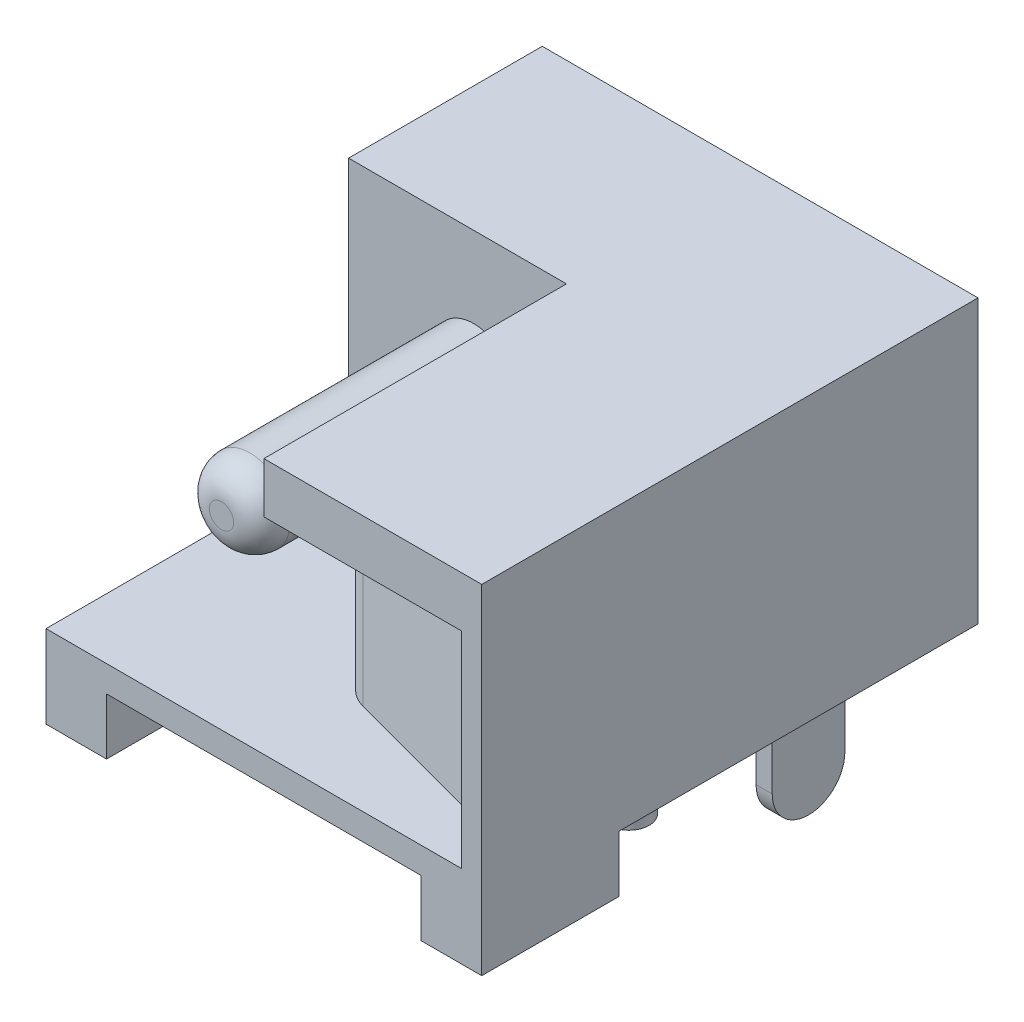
ISO-10303-21;
HEADER;
FILE_DESCRIPTION(('STEP AP214'),'2;1');
FILE_NAME('part.step','',(''),(''),'','','');
FILE_SCHEMA(('AUTOMOTIVE_DESIGN { 1 0 10303 214 1 1 1 1 }'));
ENDSEC;
DATA;
#1=APPLICATION_CONTEXT('core data for automotive mechanical design processes');
#2=APPLICATION_PROTOCOL_DEFINITION('international standard','automotive_design',2000,#1);
#3=PRODUCT_CONTEXT('',#1,'mechanical');
#4=PRODUCT('Part','Part','',(#3));
#5=PRODUCT_RELATED_PRODUCT_CATEGORY('part','',(#4));
#6=PRODUCT_DEFINITION_FORMATION('','',#4);
#7=PRODUCT_DEFINITION_CONTEXT('part definition',#1,'design');
#8=PRODUCT_DEFINITION('design','',#6,#7);
#9=PRODUCT_DEFINITION_SHAPE('','',#8);
#10=(LENGTH_UNIT() NAMED_UNIT(*) SI_UNIT(.MILLI.,.METRE.));
#11=(NAMED_UNIT(*) PLANE_ANGLE_UNIT() SI_UNIT($,.RADIAN.));
#12=(NAMED_UNIT(*) SI_UNIT($,.STERADIAN.) SOLID_ANGLE_UNIT());
#13=UNCERTAINTY_MEASURE_WITH_UNIT(LENGTH_MEASURE(1.E-05),#10,'distance_accuracy_value','');
#14=(GEOMETRIC_REPRESENTATION_CONTEXT(3) GLOBAL_UNCERTAINTY_ASSIGNED_CONTEXT((#13)) GLOBAL_UNIT_ASSIGNED_CONTEXT((#10,
#11,#12)) REPRESENTATION_CONTEXT('',''));
#15=CARTESIAN_POINT('',(0.,0.,0.));
#16=DIRECTION('',(0.,0.,1.));
#17=DIRECTION('',(1.,0.,0.));
#18=AXIS2_PLACEMENT_3D('',#15,#16,#17);
#19=CARTESIAN_POINT('',(-2.3,4.8,-1.25));
#20=DIRECTION('',(0.,0.,1.));
#21=DIRECTION('',(1.,0.,0.));
#22=AXIS2_PLACEMENT_3D('',#19,#20,#21);
#23=PLANE('',#22);
#24=CARTESIAN_POINT('',(-2.3,4.8,-1.25));
#25=DIRECTION('',(0.,0.,-1.));
#26=DIRECTION('',(-1.,0.,0.));
#27=AXIS2_PLACEMENT_3D('',#24,#25,#26);
#28=CIRCLE('',#27,0.300000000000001);
#29=CARTESIAN_POINT('',(-2.6,4.8,-1.25));
#30=VERTEX_POINT('',#29);
#31=CARTESIAN_POINT('',(-2.,4.8,-1.25));
#32=VERTEX_POINT('',#31);
#33=EDGE_CURVE('E365',#30,#32,#28,.T.);
#34=ORIENTED_EDGE('',*,*,#33,.F.);
#35=CARTESIAN_POINT('',(-2.3,4.8,-1.25));
#36=DIRECTION('',(0.,0.,-1.));
#37=DIRECTION('',(1.,0.,0.));
#38=AXIS2_PLACEMENT_3D('',#35,#36,#37);
#39=CIRCLE('',#38,0.3);
#40=EDGE_CURVE('E366',#32,#30,#39,.T.);
#41=ORIENTED_EDGE('',*,*,#40,.F.);
#42=EDGE_LOOP('',(#34,#41));
#43=FACE_BOUND('',#42,.T.);
#44=ADVANCED_FACE('F15',(#43),#23,.T.);
#45=CARTESIAN_POINT('',(0.46155033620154,1.45,-3.22455518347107));
#46=DIRECTION('',(0.,1.,0.));
#47=DIRECTION('',(0.,0.,-1.));
#48=AXIS2_PLACEMENT_3D('',#45,#46,#47);
#49=CYLINDRICAL_SURFACE('',#48,1.);
#50=CARTESIAN_POINT('',(0.46155033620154,6.55,-3.22455518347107));
#51=DIRECTION('',(0.,1.,0.));
#52=DIRECTION('',(0.,0.,-1.));
#53=AXIS2_PLACEMENT_3D('',#50,#51,#52);
#54=CIRCLE('',#53,1.);
#55=CARTESIAN_POINT('',(-0.523257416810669,6.55,-3.398203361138));
#56=VERTEX_POINT('',#55);
#57=CARTESIAN_POINT('',(0.,6.55,-2.33744116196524));
#58=VERTEX_POINT('',#57);
#59=EDGE_CURVE('E169',#56,#58,#54,.T.);
#60=ORIENTED_EDGE('',*,*,#59,.F.);
#61=DIRECTION('',(0.,1.,0.));
#62=VECTOR('',#61,1.);
#63=CARTESIAN_POINT('',(-0.523257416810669,1.45,-3.398203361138));
#64=LINE('',#63,#62);
#65=CARTESIAN_POINT('',(-0.523257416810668,1.45,-3.398203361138));
#66=VERTEX_POINT('',#65);
#67=EDGE_CURVE('E159',#66,#56,#64,.T.);
#68=ORIENTED_EDGE('',*,*,#67,.F.);
#69=CARTESIAN_POINT('',(0.46155033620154,1.45,-3.22455518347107));
#70=DIRECTION('',(0.,1.,0.));
#71=DIRECTION('',(0.,0.,-1.));
#72=AXIS2_PLACEMENT_3D('',#69,#70,#71);
#73=CIRCLE('',#72,1.);
#74=CARTESIAN_POINT('',(0.202731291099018,1.45,-2.258629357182));
#75=VERTEX_POINT('',#74);
#76=EDGE_CURVE('E150',#66,#75,#73,.T.);
#77=ORIENTED_EDGE('',*,*,#76,.T.);
#78=DIRECTION('',(0.,1.,0.));
#79=VECTOR('',#78,1.);
#80=CARTESIAN_POINT('',(0.20273129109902,6.55,-2.258629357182));
#81=LINE('',#80,#79);
#82=CARTESIAN_POINT('',(0.202731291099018,6.55,-2.258629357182));
#83=VERTEX_POINT('',#82);
#84=EDGE_CURVE('E156',#83,#75,#81,.F.);
#85=ORIENTED_EDGE('',*,*,#84,.F.);
#86=CARTESIAN_POINT('',(0.46155033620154,6.55,-3.22455518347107));
#87=DIRECTION('',(0.,1.,0.));
#88=DIRECTION('',(0.,0.,-1.));
#89=AXIS2_PLACEMENT_3D('',#86,#87,#88);
#90=CIRCLE('',#89,1.);
#91=EDGE_CURVE('E161',#83,#58,#90,.F.);
#92=ORIENTED_EDGE('',*,*,#91,.T.);
#93=EDGE_LOOP('',(#60,#68,#77,#85,#92));
#94=FACE_BOUND('',#93,.T.);
#95=ADVANCED_FACE('F155',(#94),#49,.T.);
#96=CARTESIAN_POINT('',(-2.,4.8,-1.95));
#97=DIRECTION('',(0.,1.,0.));
#98=DIRECTION('',(1.,0.,0.));
#99=AXIS2_PLACEMENT_3D('',#96,#97,#98);
#100=CIRCLE('',#99,0.7);
#101=TRIMMED_CURVE('',#100,(PARAMETER_VALUE(-2.01370737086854)),
(PARAMETER_VALUE(2.01370737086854)),.T.,.PARAMETER.);
#102=CARTESIAN_POINT('',(-2.3,4.8,-1.95));
#103=DIRECTION('',(0.,0.,1.));
#104=AXIS1_PLACEMENT('',#102,#103);
#105=SURFACE_OF_REVOLUTION('',#101,#104);
#106=ORIENTED_EDGE('',*,*,#40,.T.);
#107=ORIENTED_EDGE('',*,*,#33,.T.);
#108=EDGE_LOOP('',(#106,#107));
#109=FACE_BOUND('',#108,.T.);
#110=CARTESIAN_POINT('',(-2.3,4.8,-1.95));
#111=DIRECTION('',(0.,0.,-1.));
#112=DIRECTION('',(-1.,0.,0.));
#113=AXIS2_PLACEMENT_3D('',#110,#111,#112);
#114=CIRCLE('',#113,1.);
#115=CARTESIAN_POINT('',(-3.3,4.8,-1.95));
#116=VERTEX_POINT('',#115);
#117=EDGE_CURVE('E265',#116,#116,#114,.T.);
#118=ORIENTED_EDGE('',*,*,#117,.F.);
#119=EDGE_LOOP('',(#118));
#120=FACE_BOUND('',#119,.T.);
#121=ADVANCED_FACE('F298',(#109,#120),#105,.F.);
#122=CARTESIAN_POINT('',(0.2,6.55,-7.5));
#123=DIRECTION('',(0.,1.,0.));
#124=DIRECTION('',(0.,0.,-1.));
#125=AXIS2_PLACEMENT_3D('',#122,#123,#124);
#126=PLANE('',#125);
#127=ORIENTED_EDGE('',*,*,#59,.T.);
#128=DIRECTION('',(0.,0.,1.));
#129=VECTOR('',#128,1.);
#130=CARTESIAN_POINT('',(0.,6.55,-7.5));
#131=LINE('',#130,#129);
#132=CARTESIAN_POINT('',(0.,6.55,-6.36574363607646));
#133=VERTEX_POINT('',#132);
#134=EDGE_CURVE('E261',#58,#133,#131,.F.);
#135=ORIENTED_EDGE('',*,*,#134,.T.);
#136=DIRECTION('',(-0.173648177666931,0.,0.984807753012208));
#137=VECTOR('',#136,1.);
#138=CARTESIAN_POINT('',(0.2,6.55,-7.5));
#139=LINE('',#138,#137);
#140=EDGE_CURVE('E235',#56,#133,#139,.F.);
#141=ORIENTED_EDGE('',*,*,#140,.F.);
#142=EDGE_LOOP('',(#127,#135,#141));
#143=FACE_BOUND('',#142,.T.);
#144=ADVANCED_FACE('F302',(#143),#126,.T.);
#145=CARTESIAN_POINT('',(4.9,6.55,-1.));
#146=DIRECTION('',(-0.258819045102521,0.,0.965925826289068));
#147=DIRECTION('',(0.965925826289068,0.,0.258819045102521));
#148=AXIS2_PLACEMENT_3D('',#145,#146,#147);
#149=PLANE('',#148);
#150=DIRECTION('',(0.965925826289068,0.,0.258819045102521));
#151=VECTOR('',#150,1.);
#152=CARTESIAN_POINT('',(0.202731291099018,1.45,-2.258629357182));
#153=LINE('',#152,#151);
#154=CARTESIAN_POINT('',(4.9,1.45,-1.));
#155=VERTEX_POINT('',#154);
#156=EDGE_CURVE('E166',#75,#155,#153,.T.);
#157=ORIENTED_EDGE('',*,*,#156,.T.);
#158=DIRECTION('',(0.,1.,0.));
#159=VECTOR('',#158,1.);
#160=CARTESIAN_POINT('',(4.9,6.55,-1.));
#161=LINE('',#160,#159);
#162=CARTESIAN_POINT('',(4.9,6.55,-1.));
#163=VERTEX_POINT('',#162);
#164=EDGE_CURVE('E180',#155,#163,#161,.T.);
#165=ORIENTED_EDGE('',*,*,#164,.T.);
#166=DIRECTION('',(-0.965925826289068,0.,-0.258819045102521));
#167=VECTOR('',#166,1.);
#168=CARTESIAN_POINT('',(4.9,6.55,-1.));
#169=LINE('',#168,#167);
#170=EDGE_CURVE('E168',#163,#83,#169,.T.);
#171=ORIENTED_EDGE('',*,*,#170,.T.);
#172=ORIENTED_EDGE('',*,*,#84,.T.);
#173=EDGE_LOOP('',(#157,#165,#171,#172));
#174=FACE_BOUND('',#173,.T.);
#175=ADVANCED_FACE('F164',(#174),#149,.T.);
#176=CARTESIAN_POINT('',(0.2,1.45,-7.5));
#177=DIRECTION('',(-0.984807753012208,0.,-0.173648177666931));
#178=DIRECTION('',(-0.173648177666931,0.,0.984807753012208));
#179=AXIS2_PLACEMENT_3D('',#176,#177,#178);
#180=PLANE('',#179);
#181=DIRECTION('',(0.173648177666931,0.,-0.984807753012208));
#182=VECTOR('',#181,1.);
#183=CARTESIAN_POINT('',(0.,6.55,-6.36574363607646));
#184=LINE('',#183,#182);
#185=CARTESIAN_POINT('',(0.2,6.55,-7.5));
#186=VERTEX_POINT('',#185);
#187=EDGE_CURVE('E285',#133,#186,#184,.T.);
#188=ORIENTED_EDGE('',*,*,#187,.T.);
#189=DIRECTION('',(0.,1.,0.));
#190=VECTOR('',#189,1.);
#191=CARTESIAN_POINT('',(0.2,1.45,-7.5));
#192=LINE('',#191,#190);
#193=CARTESIAN_POINT('',(0.200000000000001,1.45,-7.5));
#194=VERTEX_POINT('',#193);
#195=EDGE_CURVE('E236',#194,#186,#192,.T.);
#196=ORIENTED_EDGE('',*,*,#195,.F.);
#197=DIRECTION('',(-0.173648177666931,0.,0.984807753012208));
#198=VECTOR('',#197,1.);
#199=CARTESIAN_POINT('',(0.2,1.45,-7.5));
#200=LINE('',#199,#198);
#201=EDGE_CURVE('E176',#194,#66,#200,.T.);
#202=ORIENTED_EDGE('',*,*,#201,.T.);
#203=ORIENTED_EDGE('',*,*,#67,.T.);
#204=ORIENTED_EDGE('',*,*,#140,.T.);
#205=EDGE_LOOP('',(#188,#196,#202,#203,#204));
#206=FACE_BOUND('',#205,.T.);
#207=ADVANCED_FACE('F811',(#206),#180,.T.);
#208=CARTESIAN_POINT('',(0.2,6.55,-7.5));
#209=DIRECTION('',(0.,1.,0.));
#210=DIRECTION('',(0.,0.,-1.));
#211=AXIS2_PLACEMENT_3D('',#208,#209,#210);
#212=PLANE('',#211);
#213=DIRECTION('',(0.,0.,1.));
#214=VECTOR('',#213,1.);
#215=CARTESIAN_POINT('',(0.,6.55,-7.5));
#216=LINE('',#215,#214);
#217=CARTESIAN_POINT('',(0.,6.55,-7.5));
#218=VERTEX_POINT('',#217);
#219=EDGE_CURVE('E264',#133,#218,#216,.F.);
#220=ORIENTED_EDGE('',*,*,#219,.T.);
#221=DIRECTION('',(1.,0.,0.));
#222=VECTOR('',#221,1.);
#223=CARTESIAN_POINT('',(-5.4,6.55,-7.5));
#224=LINE('',#223,#222);
#225=EDGE_CURVE('E239',#186,#218,#224,.F.);
#226=ORIENTED_EDGE('',*,*,#225,.F.);
#227=ORIENTED_EDGE('',*,*,#187,.F.);
#228=EDGE_LOOP('',(#220,#226,#227));
#229=FACE_BOUND('',#228,.T.);
#230=ADVANCED_FACE('F807',(#229),#212,.F.);
#231=CARTESIAN_POINT('',(-2.3,4.8,-1.25));
#232=DIRECTION('',(0.,0.,-1.));
#233=DIRECTION('',(-1.,0.,0.));
#234=AXIS2_PLACEMENT_3D('',#231,#232,#233);
#235=CYLINDRICAL_SURFACE('',#234,1.);
#236=CARTESIAN_POINT('',(-2.3,4.8,-7.5));
#237=DIRECTION('',(0.,0.,-1.));
#238=DIRECTION('',(-1.,0.,0.));
#239=AXIS2_PLACEMENT_3D('',#236,#237,#238);
#240=CIRCLE('',#239,1.);
#241=CARTESIAN_POINT('',(-3.3,4.8,-7.5));
#242=VERTEX_POINT('',#241);
#243=EDGE_CURVE('E275',#242,#242,#240,.T.);
#244=ORIENTED_EDGE('',*,*,#243,.F.);
#245=EDGE_LOOP('',(#244));
#246=FACE_BOUND('',#245,.T.);
#247=ORIENTED_EDGE('',*,*,#117,.T.);
#248=EDGE_LOOP('',(#247));
#249=FACE_BOUND('',#248,.T.);
#250=ADVANCED_FACE('F804',(#246,#249),#235,.T.);
#251=CARTESIAN_POINT('',(0.,7.8,-7.5));
#252=DIRECTION('',(1.,0.,0.));
#253=DIRECTION('',(0.,1.,0.));
#254=AXIS2_PLACEMENT_3D('',#251,#252,#253);
#255=PLANE('',#254);
#256=DIRECTION('',(0.,1.,0.));
#257=VECTOR('',#256,1.);
#258=CARTESIAN_POINT('',(0.,7.8,0.));
#259=LINE('',#258,#257);
#260=CARTESIAN_POINT('',(0.,7.8,0.));
#261=VERTEX_POINT('',#260);
#262=CARTESIAN_POINT('',(0.,6.55,0.));
#263=VERTEX_POINT('',#262);
#264=EDGE_CURVE('E221',#261,#263,#259,.F.);
#265=ORIENTED_EDGE('',*,*,#264,.F.);
#266=DIRECTION('',(0.,0.,1.));
#267=VECTOR('',#266,1.);
#268=CARTESIAN_POINT('',(0.,7.8,-12.3));
#269=LINE('',#268,#267);
#270=CARTESIAN_POINT('',(0.,7.8,-7.5));
#271=VERTEX_POINT('',#270);
#272=EDGE_CURVE('E271',#271,#261,#269,.T.);
#273=ORIENTED_EDGE('',*,*,#272,.F.);
#274=DIRECTION('',(0.,1.,0.));
#275=VECTOR('',#274,1.);
#276=CARTESIAN_POINT('',(0.,1.45,-7.5));
#277=LINE('',#276,#275);
#278=EDGE_CURVE('E184',#218,#271,#277,.T.);
#279=ORIENTED_EDGE('',*,*,#278,.F.);
#280=ORIENTED_EDGE('',*,*,#219,.F.);
#281=ORIENTED_EDGE('',*,*,#134,.F.);
#282=DIRECTION('',(0.,0.,-1.));
#283=VECTOR('',#282,1.);
#284=CARTESIAN_POINT('',(0.,6.55,-7.5));
#285=LINE('',#284,#283);
#286=EDGE_CURVE('E190',#58,#263,#285,.F.);
#287=ORIENTED_EDGE('',*,*,#286,.T.);
#288=EDGE_LOOP('',(#265,#273,#279,#280,#281,#287));
#289=FACE_BOUND('',#288,.T.);
#290=ADVANCED_FACE('F800',(#289),#255,.F.);
#291=CARTESIAN_POINT('',(-0.0500000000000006,0.,-9.5));
#292=DIRECTION('',(0.,-1.,0.));
#293=DIRECTION('',(1.,0.,0.));
#294=AXIS2_PLACEMENT_3D('',#291,#292,#293);
#295=PLANE('',#294);
#296=CARTESIAN_POINT('',(-0.0500000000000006,0.,-9.5));
#297=DIRECTION('',(0.,1.,0.));
#298=DIRECTION('',(-1.,0.,0.));
#299=AXIS2_PLACEMENT_3D('',#296,#297,#298);
#300=CIRCLE('',#299,0.5);
#301=CARTESIAN_POINT('',(-0.550000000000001,0.,-9.5));
#302=VERTEX_POINT('',#301);
#303=EDGE_CURVE('E357',#302,#302,#300,.T.);
#304=ORIENTED_EDGE('',*,*,#303,.F.);
#305=EDGE_LOOP('',(#304));
#306=FACE_BOUND('',#305,.T.);
#307=ADVANCED_FACE('F796',(#306),#295,.T.);
#308=CARTESIAN_POINT('',(3.3,-2.9,-10.7));
#309=DIRECTION('',(0.,0.,1.));
#310=DIRECTION('',(1.,0.,0.));
#311=AXIS2_PLACEMENT_3D('',#308,#309,#310);
#312=PLANE('',#311);
#313=DIRECTION('',(-1.,0.,0.));
#314=VECTOR('',#313,1.);
#315=CARTESIAN_POINT('',(3.7,-2.,-10.7));
#316=LINE('',#315,#314);
#317=CARTESIAN_POINT('',(3.3,-2.,-10.7));
#318=VERTEX_POINT('',#317);
#319=CARTESIAN_POINT('',(3.7,-2.,-10.7));
#320=VERTEX_POINT('',#319);
#321=EDGE_CURVE('E202',#318,#320,#316,.F.);
#322=ORIENTED_EDGE('',*,*,#321,.F.);
#323=DIRECTION('',(0.,1.,0.));
#324=VECTOR('',#323,1.);
#325=CARTESIAN_POINT('',(3.3,-2.9,-10.7));
#326=LINE('',#325,#324);
#327=CARTESIAN_POINT('',(3.3,0.800000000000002,-10.7));
#328=VERTEX_POINT('',#327);
#329=EDGE_CURVE('E473',#318,#328,#326,.T.);
#330=ORIENTED_EDGE('',*,*,#329,.T.);
#331=DIRECTION('',(1.,0.,0.));
#332=VECTOR('',#331,1.);
#333=CARTESIAN_POINT('',(3.3,0.800000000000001,-10.7));
#334=LINE('',#333,#332);
#335=CARTESIAN_POINT('',(3.7,0.800000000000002,-10.7));
#336=VERTEX_POINT('',#335);
#337=EDGE_CURVE('E210',#336,#328,#334,.F.);
#338=ORIENTED_EDGE('',*,*,#337,.F.);
#339=DIRECTION('',(0.,1.,0.));
#340=VECTOR('',#339,1.);
#341=CARTESIAN_POINT('',(3.7,-2.9,-10.7));
#342=LINE('',#341,#340);
#343=EDGE_CURVE('E356',#336,#320,#342,.F.);
#344=ORIENTED_EDGE('',*,*,#343,.T.);
#345=EDGE_LOOP('',(#322,#330,#338,#344));
#346=FACE_BOUND('',#345,.T.);
#347=ADVANCED_FACE('F792',(#346),#312,.F.);
#348=CARTESIAN_POINT('',(3.3,-2.9,-8.9));
#349=DIRECTION('',(0.,0.,-1.));
#350=DIRECTION('',(-1.,0.,0.));
#351=AXIS2_PLACEMENT_3D('',#348,#349,#350);
#352=PLANE('',#351);
#353=DIRECTION('',(1.,0.,0.));
#354=VECTOR('',#353,1.);
#355=CARTESIAN_POINT('',(3.7,-2.,-8.9));
#356=LINE('',#355,#354);
#357=CARTESIAN_POINT('',(3.7,-2.,-8.9));
#358=VERTEX_POINT('',#357);
#359=CARTESIAN_POINT('',(3.3,-2.,-8.9));
#360=VERTEX_POINT('',#359);
#361=EDGE_CURVE('E205',#358,#360,#356,.F.);
#362=ORIENTED_EDGE('',*,*,#361,.F.);
#363=DIRECTION('',(0.,1.,0.));
#364=VECTOR('',#363,1.);
#365=CARTESIAN_POINT('',(3.7,-2.9,-8.9));
#366=LINE('',#365,#364);
#367=CARTESIAN_POINT('',(3.7,0.800000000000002,-8.9));
#368=VERTEX_POINT('',#367);
#369=EDGE_CURVE('E355',#358,#368,#366,.T.);
#370=ORIENTED_EDGE('',*,*,#369,.T.);
#371=DIRECTION('',(-1.,0.,0.));
#372=VECTOR('',#371,1.);
#373=CARTESIAN_POINT('',(3.3,0.800000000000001,-8.9));
#374=LINE('',#373,#372);
#375=CARTESIAN_POINT('',(3.3,0.800000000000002,-8.9));
#376=VERTEX_POINT('',#375);
#377=EDGE_CURVE('E208',#376,#368,#374,.F.);
#378=ORIENTED_EDGE('',*,*,#377,.F.);
#379=DIRECTION('',(0.,1.,0.));
#380=VECTOR('',#379,1.);
#381=CARTESIAN_POINT('',(3.3,-2.9,-8.9));
#382=LINE('',#381,#380);
#383=EDGE_CURVE('E351',#376,#360,#382,.F.);
#384=ORIENTED_EDGE('',*,*,#383,.T.);
#385=EDGE_LOOP('',(#362,#370,#378,#384));
#386=FACE_BOUND('',#385,.T.);
#387=ADVANCED_FACE('F788',(#386),#352,.F.);
#388=CARTESIAN_POINT('',(3.7,-2.,-9.8));
#389=DIRECTION('',(-1.,0.,0.));
#390=DIRECTION('',(0.,0.,1.));
#391=AXIS2_PLACEMENT_3D('',#388,#389,#390);
#392=CYLINDRICAL_SURFACE('',#391,0.9);
#393=ORIENTED_EDGE('',*,*,#321,.T.);
#394=CARTESIAN_POINT('',(3.7,-2.,-9.8));
#395=DIRECTION('',(1.,0.,0.));
#396=DIRECTION('',(0.,0.,-1.));
#397=AXIS2_PLACEMENT_3D('',#394,#395,#396);
#398=CIRCLE('',#397,0.9);
#399=EDGE_CURVE('E352',#320,#358,#398,.F.);
#400=ORIENTED_EDGE('',*,*,#399,.T.);
#401=ORIENTED_EDGE('',*,*,#361,.T.);
#402=CARTESIAN_POINT('',(3.3,-2.,-9.8));
#403=DIRECTION('',(-1.,0.,0.));
#404=DIRECTION('',(0.,0.,1.));
#405=AXIS2_PLACEMENT_3D('',#402,#403,#404);
#406=CIRCLE('',#405,0.9);
#407=EDGE_CURVE('E347',#360,#318,#406,.F.);
#408=ORIENTED_EDGE('',*,*,#407,.T.);
#409=EDGE_LOOP('',(#393,#400,#401,#408));
#410=FACE_BOUND('',#409,.T.);
#411=ADVANCED_FACE('F784',(#410),#392,.T.);
#412=CARTESIAN_POINT('',(-5.4,-0.599999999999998,-3.5));
#413=DIRECTION('',(0.,1.,0.));
#414=DIRECTION('',(-1.,0.,0.));
#415=AXIS2_PLACEMENT_3D('',#412,#413,#414);
#416=PLANE('',#415);
#417=DIRECTION('',(0.,0.,1.));
#418=VECTOR('',#417,1.);
#419=CARTESIAN_POINT('',(5.4,-0.599999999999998,-12.3));
#420=LINE('',#419,#418);
#421=CARTESIAN_POINT('',(5.4,-0.599999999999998,0.));
#422=VERTEX_POINT('',#421);
#423=CARTESIAN_POINT('',(5.4,-0.599999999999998,-3.4));
#424=VERTEX_POINT('',#423);
#425=EDGE_CURVE('E345',#422,#424,#420,.F.);
#426=ORIENTED_EDGE('',*,*,#425,.F.);
#427=DIRECTION('',(-1.,0.,0.));
#428=VECTOR('',#427,1.);
#429=CARTESIAN_POINT('',(-5.4,-0.599999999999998,0.));
#430=LINE('',#429,#428);
#431=CARTESIAN_POINT('',(3.9,-0.599999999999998,0.));
#432=VERTEX_POINT('',#431);
#433=EDGE_CURVE('E197',#432,#422,#430,.F.);
#434=ORIENTED_EDGE('',*,*,#433,.F.);
#435=DIRECTION('',(0.,0.,-1.));
#436=VECTOR('',#435,1.);
#437=CARTESIAN_POINT('',(3.9,-0.599999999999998,-3.4));
#438=LINE('',#437,#436);
#439=CARTESIAN_POINT('',(3.9,-0.599999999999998,-3.4));
#440=VERTEX_POINT('',#439);
#441=EDGE_CURVE('E501',#432,#440,#438,.T.);
#442=ORIENTED_EDGE('',*,*,#441,.T.);
#443=DIRECTION('',(1.,0.,0.));
#444=VECTOR('',#443,1.);
#445=CARTESIAN_POINT('',(5.4,-0.599999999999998,-3.4));
#446=LINE('',#445,#444);
#447=EDGE_CURVE('E495',#440,#424,#446,.T.);
#448=ORIENTED_EDGE('',*,*,#447,.T.);
#449=EDGE_LOOP('',(#426,#434,#442,#448));
#450=FACE_BOUND('',#449,.T.);
#451=ADVANCED_FACE('F780',(#450),#416,.F.);
#452=CARTESIAN_POINT('',(0.2,6.55,-7.5));
#453=DIRECTION('',(0.,1.,0.));
#454=DIRECTION('',(0.,0.,-1.));
#455=AXIS2_PLACEMENT_3D('',#452,#453,#454);
#456=PLANE('',#455);
#457=ORIENTED_EDGE('',*,*,#91,.F.);
#458=ORIENTED_EDGE('',*,*,#170,.F.);
#459=DIRECTION('',(0.,0.,1.));
#460=VECTOR('',#459,1.);
#461=CARTESIAN_POINT('',(4.9,6.55,-8.07248188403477));
#462=LINE('',#461,#460);
#463=CARTESIAN_POINT('',(4.9,6.55,0.));
#464=VERTEX_POINT('',#463);
#465=EDGE_CURVE('E193',#163,#464,#462,.T.);
#466=ORIENTED_EDGE('',*,*,#465,.T.);
#467=DIRECTION('',(1.,0.,0.));
#468=VECTOR('',#467,1.);
#469=CARTESIAN_POINT('',(-5.4,6.55,0.));
#470=LINE('',#469,#468);
#471=EDGE_CURVE('E253',#263,#464,#470,.T.);
#472=ORIENTED_EDGE('',*,*,#471,.F.);
#473=ORIENTED_EDGE('',*,*,#286,.F.);
#474=EDGE_LOOP('',(#457,#458,#466,#472,#473));
#475=FACE_BOUND('',#474,.T.);
#476=ADVANCED_FACE('F776',(#475),#456,.F.);
#477=CARTESIAN_POINT('',(4.9,6.55,-8.07248188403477));
#478=DIRECTION('',(1.,0.,0.));
#479=DIRECTION('',(0.,1.,0.));
#480=AXIS2_PLACEMENT_3D('',#477,#478,#479);
#481=PLANE('',#480);
#482=DIRECTION('',(0.,0.,1.));
#483=VECTOR('',#482,1.);
#484=CARTESIAN_POINT('',(4.9,1.45,-7.5));
#485=LINE('',#484,#483);
#486=CARTESIAN_POINT('',(4.9,1.45,0.));
#487=VERTEX_POINT('',#486);
#488=EDGE_CURVE('E175',#155,#487,#485,.T.);
#489=ORIENTED_EDGE('',*,*,#488,.T.);
#490=DIRECTION('',(0.,1.,0.));
#491=VECTOR('',#490,1.);
#492=CARTESIAN_POINT('',(4.9,0.800000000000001,0.));
#493=LINE('',#492,#491);
#494=EDGE_CURVE('E249',#464,#487,#493,.F.);
#495=ORIENTED_EDGE('',*,*,#494,.F.);
#496=ORIENTED_EDGE('',*,*,#465,.F.);
#497=ORIENTED_EDGE('',*,*,#164,.F.);
#498=EDGE_LOOP('',(#489,#495,#496,#497));
#499=FACE_BOUND('',#498,.T.);
#500=ADVANCED_FACE('F772',(#499),#481,.F.);
#501=CARTESIAN_POINT('',(-5.4,-0.599999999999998,-3.5));
#502=DIRECTION('',(0.,1.,0.));
#503=DIRECTION('',(-1.,0.,0.));
#504=AXIS2_PLACEMENT_3D('',#501,#502,#503);
#505=PLANE('',#504);
#506=DIRECTION('',(1.,0.,0.));
#507=VECTOR('',#506,1.);
#508=CARTESIAN_POINT('',(-5.4,-0.599999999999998,0.));
#509=LINE('',#508,#507);
#510=CARTESIAN_POINT('',(-5.4,-0.599999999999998,0.));
#511=VERTEX_POINT('',#510);
#512=CARTESIAN_POINT('',(-3.9,-0.599999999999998,0.));
#513=VERTEX_POINT('',#512);
#514=EDGE_CURVE('E508',#511,#513,#509,.T.);
#515=ORIENTED_EDGE('',*,*,#514,.F.);
#516=DIRECTION('',(0.,0.,1.));
#517=VECTOR('',#516,1.);
#518=CARTESIAN_POINT('',(-5.4,-0.599999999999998,-12.3));
#519=LINE('',#518,#517);
#520=CARTESIAN_POINT('',(-5.4,-0.599999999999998,-3.4));
#521=VERTEX_POINT('',#520);
#522=EDGE_CURVE('E527',#521,#511,#519,.T.);
#523=ORIENTED_EDGE('',*,*,#522,.F.);
#524=DIRECTION('',(1.,0.,0.));
#525=VECTOR('',#524,1.);
#526=CARTESIAN_POINT('',(-5.4,-0.599999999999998,-3.4));
#527=LINE('',#526,#525);
#528=CARTESIAN_POINT('',(-3.9,-0.599999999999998,-3.4));
#529=VERTEX_POINT('',#528);
#530=EDGE_CURVE('E521',#521,#529,#527,.T.);
#531=ORIENTED_EDGE('',*,*,#530,.T.);
#532=DIRECTION('',(0.,0.,1.));
#533=VECTOR('',#532,1.);
#534=CARTESIAN_POINT('',(-3.9,-0.599999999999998,-3.4));
#535=LINE('',#534,#533);
#536=EDGE_CURVE('E281',#529,#513,#535,.T.);
#537=ORIENTED_EDGE('',*,*,#536,.T.);
#538=EDGE_LOOP('',(#515,#523,#531,#537));
#539=FACE_BOUND('',#538,.T.);
#540=ADVANCED_FACE('F769',(#539),#505,.F.);
#541=CARTESIAN_POINT('',(-5.4,1.45,-7.5));
#542=DIRECTION('',(0.,-1.,0.));
#543=DIRECTION('',(1.,0.,0.));
#544=AXIS2_PLACEMENT_3D('',#541,#542,#543);
#545=PLANE('',#544);
#546=ORIENTED_EDGE('',*,*,#488,.F.);
#547=ORIENTED_EDGE('',*,*,#156,.F.);
#548=ORIENTED_EDGE('',*,*,#76,.F.);
#549=ORIENTED_EDGE('',*,*,#201,.F.);
#550=DIRECTION('',(1.,0.,0.));
#551=VECTOR('',#550,1.);
#552=CARTESIAN_POINT('',(-5.4,1.45,-7.5));
#553=LINE('',#552,#551);
#554=CARTESIAN_POINT('',(-5.4,1.45,-7.5));
#555=VERTEX_POINT('',#554);
#556=EDGE_CURVE('E178',#555,#194,#553,.T.);
#557=ORIENTED_EDGE('',*,*,#556,.F.);
#558=DIRECTION('',(0.,0.,1.));
#559=VECTOR('',#558,1.);
#560=CARTESIAN_POINT('',(-5.4,1.45,-12.3));
#561=LINE('',#560,#559);
#562=CARTESIAN_POINT('',(-5.4,1.45,0.));
#563=VERTEX_POINT('',#562);
#564=EDGE_CURVE('E533',#563,#555,#561,.F.);
#565=ORIENTED_EDGE('',*,*,#564,.F.);
#566=DIRECTION('',(1.,0.,0.));
#567=VECTOR('',#566,1.);
#568=CARTESIAN_POINT('',(-5.4,1.45,0.));
#569=LINE('',#568,#567);
#570=EDGE_CURVE('E252',#487,#563,#569,.F.);
#571=ORIENTED_EDGE('',*,*,#570,.F.);
#572=EDGE_LOOP('',(#546,#547,#548,#549,#557,#565,#571));
#573=FACE_BOUND('',#572,.T.);
#574=ADVANCED_FACE('F172',(#573),#545,.F.);
#575=CARTESIAN_POINT('',(-5.4,1.45,-7.5));
#576=DIRECTION('',(0.,0.,1.));
#577=DIRECTION('',(1.,0.,0.));
#578=AXIS2_PLACEMENT_3D('',#575,#576,#577);
#579=PLANE('',#578);
#580=ORIENTED_EDGE('',*,*,#243,.T.);
#581=EDGE_LOOP('',(#580));
#582=FACE_BOUND('',#581,.T.);
#583=ORIENTED_EDGE('',*,*,#278,.T.);
#584=DIRECTION('',(-1.,0.,0.));
#585=VECTOR('',#584,1.);
#586=CARTESIAN_POINT('',(-5.4,7.8,-7.5));
#587=LINE('',#586,#585);
#588=CARTESIAN_POINT('',(-5.4,7.8,-7.5));
#589=VERTEX_POINT('',#588);
#590=EDGE_CURVE('E274',#589,#271,#587,.F.);
#591=ORIENTED_EDGE('',*,*,#590,.F.);
#592=DIRECTION('',(0.,-1.,0.));
#593=VECTOR('',#592,1.);
#594=CARTESIAN_POINT('',(-5.4,7.8,-7.5));
#595=LINE('',#594,#593);
#596=EDGE_CURVE('E536',#555,#589,#595,.F.);
#597=ORIENTED_EDGE('',*,*,#596,.F.);
#598=ORIENTED_EDGE('',*,*,#556,.T.);
#599=ORIENTED_EDGE('',*,*,#195,.T.);
#600=ORIENTED_EDGE('',*,*,#225,.T.);
#601=EDGE_LOOP('',(#583,#591,#597,#598,#599,#600));
#602=FACE_BOUND('',#601,.T.);
#603=ADVANCED_FACE('F398',(#582,#602),#579,.T.);
#604=CARTESIAN_POINT('',(-5.4,7.8,-12.3));
#605=DIRECTION('',(0.,1.,0.));
#606=DIRECTION('',(-1.,0.,0.));
#607=AXIS2_PLACEMENT_3D('',#604,#605,#606);
#608=PLANE('',#607);
#609=DIRECTION('',(0.,0.,1.));
#610=VECTOR('',#609,1.);
#611=CARTESIAN_POINT('',(-5.4,7.8,-12.3));
#612=LINE('',#611,#610);
#613=CARTESIAN_POINT('',(-5.4,7.8,-12.3));
#614=VERTEX_POINT('',#613);
#615=EDGE_CURVE('E411',#589,#614,#612,.F.);
#616=ORIENTED_EDGE('',*,*,#615,.F.);
#617=ORIENTED_EDGE('',*,*,#590,.T.);
#618=ORIENTED_EDGE('',*,*,#272,.T.);
#619=DIRECTION('',(1.,0.,0.));
#620=VECTOR('',#619,1.);
#621=CARTESIAN_POINT('',(-5.4,7.8,0.));
#622=LINE('',#621,#620);
#623=CARTESIAN_POINT('',(5.4,7.8,0.));
#624=VERTEX_POINT('',#623);
#625=EDGE_CURVE('E278',#624,#261,#622,.F.);
#626=ORIENTED_EDGE('',*,*,#625,.F.);
#627=DIRECTION('',(0.,0.,1.));
#628=VECTOR('',#627,1.);
#629=CARTESIAN_POINT('',(5.4,7.8,-12.3));
#630=LINE('',#629,#628);
#631=CARTESIAN_POINT('',(5.4,7.8,-12.3));
#632=VERTEX_POINT('',#631);
#633=EDGE_CURVE('E492',#632,#624,#630,.T.);
#634=ORIENTED_EDGE('',*,*,#633,.F.);
#635=DIRECTION('',(1.,0.,0.));
#636=VECTOR('',#635,1.);
#637=CARTESIAN_POINT('',(-5.4,7.8,-12.3));
#638=LINE('',#637,#636);
#639=EDGE_CURVE('E545',#632,#614,#638,.F.);
#640=ORIENTED_EDGE('',*,*,#639,.T.);
#641=EDGE_LOOP('',(#616,#617,#618,#626,#634,#640));
#642=FACE_BOUND('',#641,.T.);
#643=ADVANCED_FACE('F407',(#642),#608,.T.);
#644=CARTESIAN_POINT('',(0.299999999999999,-2.9,-10.5));
#645=DIRECTION('',(0.,0.,-1.));
#646=DIRECTION('',(-1.,0.,0.));
#647=AXIS2_PLACEMENT_3D('',#644,#645,#646);
#648=PLANE('',#647);
#649=DIRECTION('',(1.,0.,0.));
#650=VECTOR('',#649,1.);
#651=CARTESIAN_POINT('',(0.699999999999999,-2.,-10.5));
#652=LINE('',#651,#650);
#653=CARTESIAN_POINT('',(0.699999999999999,-2.,-10.5));
#654=VERTEX_POINT('',#653);
#655=CARTESIAN_POINT('',(0.299999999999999,-2.,-10.5));
#656=VERTEX_POINT('',#655);
#657=EDGE_CURVE('E414',#654,#656,#652,.F.);
#658=ORIENTED_EDGE('',*,*,#657,.F.);
#659=DIRECTION('',(0.,1.,0.));
#660=VECTOR('',#659,1.);
#661=CARTESIAN_POINT('',(0.699999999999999,-2.9,-10.5));
#662=LINE('',#661,#660);
#663=CARTESIAN_POINT('',(0.699999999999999,0.800000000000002,-10.5));
#664=VERTEX_POINT('',#663);
#665=EDGE_CURVE('E350',#654,#664,#662,.T.);
#666=ORIENTED_EDGE('',*,*,#665,.T.);
#667=DIRECTION('',(-1.,0.,0.));
#668=VECTOR('',#667,1.);
#669=CARTESIAN_POINT('',(0.299999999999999,0.800000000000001,-10.5));
#670=LINE('',#669,#668);
#671=CARTESIAN_POINT('',(0.299999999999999,0.800000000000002,-10.5));
#672=VERTEX_POINT('',#671);
#673=EDGE_CURVE('E413',#672,#664,#670,.F.);
#674=ORIENTED_EDGE('',*,*,#673,.F.);
#675=DIRECTION('',(0.,1.,0.));
#676=VECTOR('',#675,1.);
#677=CARTESIAN_POINT('',(0.299999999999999,-2.9,-10.5));
#678=LINE('',#677,#676);
#679=EDGE_CURVE('E341',#672,#656,#678,.F.);
#680=ORIENTED_EDGE('',*,*,#679,.T.);
#681=EDGE_LOOP('',(#658,#666,#674,#680));
#682=FACE_BOUND('',#681,.T.);
#683=ADVANCED_FACE('F757',(#682),#648,.F.);
#684=CARTESIAN_POINT('',(0.699999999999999,-2.,-11.4));
#685=DIRECTION('',(-1.,0.,0.));
#686=DIRECTION('',(0.,0.,1.));
#687=AXIS2_PLACEMENT_3D('',#684,#685,#686);
#688=CYLINDRICAL_SURFACE('',#687,0.9);
#689=DIRECTION('',(1.,0.,0.));
#690=VECTOR('',#689,1.);
#691=CARTESIAN_POINT('',(-5.4,-2.,-12.3));
#692=LINE('',#691,#690);
#693=CARTESIAN_POINT('',(0.299999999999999,-2.,-12.3));
#694=VERTEX_POINT('',#693);
#695=CARTESIAN_POINT('',(0.699999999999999,-2.,-12.3));
#696=VERTEX_POINT('',#695);
#697=EDGE_CURVE('E431',#694,#696,#692,.T.);
#698=ORIENTED_EDGE('',*,*,#697,.T.);
#699=CARTESIAN_POINT('',(0.699999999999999,-2.,-11.4));
#700=DIRECTION('',(1.,0.,0.));
#701=DIRECTION('',(0.,0.,-1.));
#702=AXIS2_PLACEMENT_3D('',#699,#700,#701);
#703=CIRCLE('',#702,0.9);
#704=EDGE_CURVE('E342',#696,#654,#703,.F.);
#705=ORIENTED_EDGE('',*,*,#704,.T.);
#706=ORIENTED_EDGE('',*,*,#657,.T.);
#707=CARTESIAN_POINT('',(0.299999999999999,-2.,-11.4));
#708=DIRECTION('',(-1.,0.,0.));
#709=DIRECTION('',(0.,0.,1.));
#710=AXIS2_PLACEMENT_3D('',#707,#708,#709);
#711=CIRCLE('',#710,0.9);
#712=EDGE_CURVE('E338',#656,#694,#711,.F.);
#713=ORIENTED_EDGE('',*,*,#712,.T.);
#714=EDGE_LOOP('',(#698,#705,#706,#713));
#715=FACE_BOUND('',#714,.T.);
#716=ADVANCED_FACE('F753',(#715),#688,.T.);
#717=CARTESIAN_POINT('',(-4.4,-2.9,-11.6));
#718=DIRECTION('',(1.,0.,0.));
#719=DIRECTION('',(0.,0.,-1.));
#720=AXIS2_PLACEMENT_3D('',#717,#718,#719);
#721=PLANE('',#720);
#722=DIRECTION('',(0.,0.,1.));
#723=VECTOR('',#722,1.);
#724=CARTESIAN_POINT('',(-4.4,-2.,-11.6));
#725=LINE('',#724,#723);
#726=CARTESIAN_POINT('',(-4.4,-2.,-11.2));
#727=VERTEX_POINT('',#726);
#728=CARTESIAN_POINT('',(-4.4,-2.,-11.6));
#729=VERTEX_POINT('',#728);
#730=EDGE_CURVE('E360',#727,#729,#725,.F.);
#731=ORIENTED_EDGE('',*,*,#730,.F.);
#732=DIRECTION('',(0.,1.,0.));
#733=VECTOR('',#732,1.);
#734=CARTESIAN_POINT('',(-4.4,-2.9,-11.2));
#735=LINE('',#734,#733);
#736=CARTESIAN_POINT('',(-4.4,0.800000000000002,-11.2));
#737=VERTEX_POINT('',#736);
#738=EDGE_CURVE('E566',#727,#737,#735,.T.);
#739=ORIENTED_EDGE('',*,*,#738,.T.);
#740=DIRECTION('',(0.,0.,-1.));
#741=VECTOR('',#740,1.);
#742=CARTESIAN_POINT('',(-4.4,0.800000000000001,-11.6));
#743=LINE('',#742,#741);
#744=CARTESIAN_POINT('',(-4.4,0.800000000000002,-11.6));
#745=VERTEX_POINT('',#744);
#746=EDGE_CURVE('E36',#745,#737,#743,.F.);
#747=ORIENTED_EDGE('',*,*,#746,.F.);
#748=DIRECTION('',(0.,1.,0.));
#749=VECTOR('',#748,1.);
#750=CARTESIAN_POINT('',(-4.4,-2.9,-11.6));
#751=LINE('',#750,#749);
#752=EDGE_CURVE('E337',#745,#729,#751,.F.);
#753=ORIENTED_EDGE('',*,*,#752,.T.);
#754=EDGE_LOOP('',(#731,#739,#747,#753));
#755=FACE_BOUND('',#754,.T.);
#756=ADVANCED_FACE('F750',(#755),#721,.F.);
#757=CARTESIAN_POINT('',(-2.6,-2.9,-11.6));
#758=DIRECTION('',(-1.,0.,0.));
#759=DIRECTION('',(0.,0.,1.));
#760=AXIS2_PLACEMENT_3D('',#757,#758,#759);
#761=PLANE('',#760);
#762=DIRECTION('',(0.,0.,-1.));
#763=VECTOR('',#762,1.);
#764=CARTESIAN_POINT('',(-2.6,-2.,-11.6));
#765=LINE('',#764,#763);
#766=CARTESIAN_POINT('',(-2.6,-2.,-11.6));
#767=VERTEX_POINT('',#766);
#768=CARTESIAN_POINT('',(-2.6,-2.,-11.2));
#769=VERTEX_POINT('',#768);
#770=EDGE_CURVE('E460',#767,#769,#765,.F.);
#771=ORIENTED_EDGE('',*,*,#770,.F.);
#772=DIRECTION('',(0.,1.,0.));
#773=VECTOR('',#772,1.);
#774=CARTESIAN_POINT('',(-2.6,-2.9,-11.6));
#775=LINE('',#774,#773);
#776=CARTESIAN_POINT('',(-2.6,0.800000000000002,-11.6));
#777=VERTEX_POINT('',#776);
#778=EDGE_CURVE('E336',#767,#777,#775,.T.);
#779=ORIENTED_EDGE('',*,*,#778,.T.);
#780=DIRECTION('',(0.,0.,1.));
#781=VECTOR('',#780,1.);
#782=CARTESIAN_POINT('',(-2.6,0.800000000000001,-11.6));
#783=LINE('',#782,#781);
#784=CARTESIAN_POINT('',(-2.6,0.800000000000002,-11.2));
#785=VERTEX_POINT('',#784);
#786=EDGE_CURVE('E452',#785,#777,#783,.F.);
#787=ORIENTED_EDGE('',*,*,#786,.F.);
#788=DIRECTION('',(0.,1.,0.));
#789=VECTOR('',#788,1.);
#790=CARTESIAN_POINT('',(-2.6,-2.9,-11.2));
#791=LINE('',#790,#789);
#792=EDGE_CURVE('E332',#785,#769,#791,.F.);
#793=ORIENTED_EDGE('',*,*,#792,.T.);
#794=EDGE_LOOP('',(#771,#779,#787,#793));
#795=FACE_BOUND('',#794,.T.);
#796=ADVANCED_FACE('F658',(#795),#761,.F.);
#797=CARTESIAN_POINT('',(-3.5,-2.,-11.6));
#798=DIRECTION('',(0.,0.,1.));
#799=DIRECTION('',(1.,0.,0.));
#800=AXIS2_PLACEMENT_3D('',#797,#798,#799);
#801=CYLINDRICAL_SURFACE('',#800,0.9);
#802=ORIENTED_EDGE('',*,*,#730,.T.);
#803=CARTESIAN_POINT('',(-3.5,-2.,-11.6));
#804=DIRECTION('',(0.,0.,-1.));
#805=DIRECTION('',(-1.,0.,0.));
#806=AXIS2_PLACEMENT_3D('',#803,#804,#805);
#807=CIRCLE('',#806,0.9);
#808=EDGE_CURVE('E333',#729,#767,#807,.F.);
#809=ORIENTED_EDGE('',*,*,#808,.T.);
#810=ORIENTED_EDGE('',*,*,#770,.T.);
#811=CARTESIAN_POINT('',(-3.5,-2.,-11.2));
#812=DIRECTION('',(0.,0.,1.));
#813=DIRECTION('',(1.,0.,0.));
#814=AXIS2_PLACEMENT_3D('',#811,#812,#813);
#815=CIRCLE('',#814,0.9);
#816=EDGE_CURVE('E329',#769,#727,#815,.F.);
#817=ORIENTED_EDGE('',*,*,#816,.T.);
#818=EDGE_LOOP('',(#802,#809,#810,#817));
#819=FACE_BOUND('',#818,.T.);
#820=ADVANCED_FACE('F743',(#819),#801,.T.);
#821=CARTESIAN_POINT('',(-4.35,0.,-4.7));
#822=DIRECTION('',(0.,-1.,0.));
#823=DIRECTION('',(1.,0.,0.));
#824=AXIS2_PLACEMENT_3D('',#821,#822,#823);
#825=PLANE('',#824);
#826=CARTESIAN_POINT('',(-4.35,0.,-4.7));
#827=DIRECTION('',(0.,1.,0.));
#828=DIRECTION('',(-1.,0.,0.));
#829=AXIS2_PLACEMENT_3D('',#826,#827,#828);
#830=CIRCLE('',#829,0.5);
#831=CARTESIAN_POINT('',(-4.85,0.,-4.7));
#832=VERTEX_POINT('',#831);
#833=EDGE_CURVE('E326',#832,#832,#830,.T.);
#834=ORIENTED_EDGE('',*,*,#833,.F.);
#835=EDGE_LOOP('',(#834));
#836=FACE_BOUND('',#835,.T.);
#837=ADVANCED_FACE('F739',(#836),#825,.T.);
#838=CARTESIAN_POINT('',(4.35,0.,-4.7));
#839=DIRECTION('',(0.,1.,0.));
#840=DIRECTION('',(-1.,0.,0.));
#841=AXIS2_PLACEMENT_3D('',#838,#839,#840);
#842=PLANE('',#841);
#843=CARTESIAN_POINT('',(4.35,0.,-4.7));
#844=DIRECTION('',(0.,1.,0.));
#845=DIRECTION('',(-1.,0.,0.));
#846=AXIS2_PLACEMENT_3D('',#843,#844,#845);
#847=CIRCLE('',#846,0.5);
#848=CARTESIAN_POINT('',(3.85,0.,-4.7));
#849=VERTEX_POINT('',#848);
#850=EDGE_CURVE('E323',#849,#849,#847,.T.);
#851=ORIENTED_EDGE('',*,*,#850,.F.);
#852=EDGE_LOOP('',(#851));
#853=FACE_BOUND('',#852,.T.);
#854=ADVANCED_FACE('F735',(#853),#842,.F.);
#855=CARTESIAN_POINT('',(-0.0500000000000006,0.,-9.5));
#856=DIRECTION('',(0.,1.,0.));
#857=DIRECTION('',(-1.,0.,0.));
#858=AXIS2_PLACEMENT_3D('',#855,#856,#857);
#859=CYLINDRICAL_SURFACE('',#858,0.5);
#860=CARTESIAN_POINT('',(-0.0500000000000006,0.800000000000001,-9.5));
#861=DIRECTION('',(0.,1.,0.));
#862=DIRECTION('',(-1.,0.,0.));
#863=AXIS2_PLACEMENT_3D('',#860,#861,#862);
#864=CIRCLE('',#863,0.5);
#865=CARTESIAN_POINT('',(-0.550000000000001,0.800000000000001,-9.5));
#866=VERTEX_POINT('',#865);
#867=EDGE_CURVE('E226',#866,#866,#864,.T.);
#868=ORIENTED_EDGE('',*,*,#867,.F.);
#869=EDGE_LOOP('',(#868));
#870=FACE_BOUND('',#869,.T.);
#871=ORIENTED_EDGE('',*,*,#303,.T.);
#872=EDGE_LOOP('',(#871));
#873=FACE_BOUND('',#872,.T.);
#874=ADVANCED_FACE('F731',(#870,#873),#859,.T.);
#875=CARTESIAN_POINT('',(3.7,-2.9,-10.7));
#876=DIRECTION('',(-1.,0.,0.));
#877=DIRECTION('',(0.,0.,1.));
#878=AXIS2_PLACEMENT_3D('',#875,#876,#877);
#879=PLANE('',#878);
#880=ORIENTED_EDGE('',*,*,#399,.F.);
#881=ORIENTED_EDGE('',*,*,#343,.F.);
#882=DIRECTION('',(0.,0.,1.));
#883=VECTOR('',#882,1.);
#884=CARTESIAN_POINT('',(3.7,0.800000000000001,-12.3));
#885=LINE('',#884,#883);
#886=EDGE_CURVE('E217',#368,#336,#885,.F.);
#887=ORIENTED_EDGE('',*,*,#886,.F.);
#888=ORIENTED_EDGE('',*,*,#369,.F.);
#889=EDGE_LOOP('',(#880,#881,#887,#888));
#890=FACE_BOUND('',#889,.T.);
#891=ADVANCED_FACE('F727',(#890),#879,.F.);
#892=CARTESIAN_POINT('',(3.3,-2.9,-10.7));
#893=DIRECTION('',(1.,0.,0.));
#894=DIRECTION('',(0.,0.,-1.));
#895=AXIS2_PLACEMENT_3D('',#892,#893,#894);
#896=PLANE('',#895);
#897=ORIENTED_EDGE('',*,*,#407,.F.);
#898=ORIENTED_EDGE('',*,*,#383,.F.);
#899=DIRECTION('',(0.,0.,1.));
#900=VECTOR('',#899,1.);
#901=CARTESIAN_POINT('',(3.3,0.800000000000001,-12.3));
#902=LINE('',#901,#900);
#903=EDGE_CURVE('E213',#328,#376,#902,.T.);
#904=ORIENTED_EDGE('',*,*,#903,.F.);
#905=ORIENTED_EDGE('',*,*,#329,.F.);
#906=EDGE_LOOP('',(#897,#898,#904,#905));
#907=FACE_BOUND('',#906,.T.);
#908=ADVANCED_FACE('F723',(#907),#896,.F.);
#909=CARTESIAN_POINT('',(0.699999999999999,-2.9,-12.3));
#910=DIRECTION('',(-1.,0.,0.));
#911=DIRECTION('',(0.,0.,1.));
#912=AXIS2_PLACEMENT_3D('',#909,#910,#911);
#913=PLANE('',#912);
#914=ORIENTED_EDGE('',*,*,#704,.F.);
#915=DIRECTION('',(0.,1.,0.));
#916=VECTOR('',#915,1.);
#917=CARTESIAN_POINT('',(0.699999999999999,-2.9,-12.3));
#918=LINE('',#917,#916);
#919=CARTESIAN_POINT('',(0.699999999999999,0.800000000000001,-12.3));
#920=VERTEX_POINT('',#919);
#921=EDGE_CURVE('E346',#920,#696,#918,.F.);
#922=ORIENTED_EDGE('',*,*,#921,.F.);
#923=DIRECTION('',(0.,0.,1.));
#924=VECTOR('',#923,1.);
#925=CARTESIAN_POINT('',(0.699999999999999,0.800000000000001,-12.3));
#926=LINE('',#925,#924);
#927=EDGE_CURVE('E216',#664,#920,#926,.F.);
#928=ORIENTED_EDGE('',*,*,#927,.F.);
#929=ORIENTED_EDGE('',*,*,#665,.F.);
#930=EDGE_LOOP('',(#914,#922,#928,#929));
#931=FACE_BOUND('',#930,.T.);
#932=ADVANCED_FACE('F719',(#931),#913,.F.);
#933=CARTESIAN_POINT('',(5.4,7.8,-12.3));
#934=DIRECTION('',(1.,0.,0.));
#935=DIRECTION('',(0.,1.,0.));
#936=AXIS2_PLACEMENT_3D('',#933,#934,#935);
#937=PLANE('',#936);
#938=ORIENTED_EDGE('',*,*,#633,.T.);
#939=DIRECTION('',(0.,1.,0.));
#940=VECTOR('',#939,1.);
#941=CARTESIAN_POINT('',(5.4,0.800000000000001,0.));
#942=LINE('',#941,#940);
#943=EDGE_CURVE('E282',#422,#624,#942,.T.);
#944=ORIENTED_EDGE('',*,*,#943,.F.);
#945=ORIENTED_EDGE('',*,*,#425,.T.);
#946=DIRECTION('',(0.,1.,0.));
#947=VECTOR('',#946,1.);
#948=CARTESIAN_POINT('',(5.4,-2.9,-3.4));
#949=LINE('',#948,#947);
#950=CARTESIAN_POINT('',(5.4,0.8,-3.4));
#951=VERTEX_POINT('',#950);
#952=EDGE_CURVE('E498',#424,#951,#949,.T.);
#953=ORIENTED_EDGE('',*,*,#952,.T.);
#954=DIRECTION('',(0.,0.,1.));
#955=VECTOR('',#954,1.);
#956=CARTESIAN_POINT('',(5.4,0.800000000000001,-12.3));
#957=LINE('',#956,#955);
#958=CARTESIAN_POINT('',(5.4,0.8,-12.3));
#959=VERTEX_POINT('',#958);
#960=EDGE_CURVE('E426',#959,#951,#957,.T.);
#961=ORIENTED_EDGE('',*,*,#960,.F.);
#962=DIRECTION('',(0.,1.,0.));
#963=VECTOR('',#962,1.);
#964=CARTESIAN_POINT('',(5.4,0.800000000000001,-12.3));
#965=LINE('',#964,#963);
#966=EDGE_CURVE('E542',#959,#632,#965,.T.);
#967=ORIENTED_EDGE('',*,*,#966,.T.);
#968=EDGE_LOOP('',(#938,#944,#945,#953,#961,#967));
#969=FACE_BOUND('',#968,.T.);
#970=ADVANCED_FACE('F715',(#969),#937,.T.);
#971=CARTESIAN_POINT('',(5.4,-2.9,-3.4));
#972=DIRECTION('',(0.,0.,1.));
#973=DIRECTION('',(1.,0.,0.));
#974=AXIS2_PLACEMENT_3D('',#971,#972,#973);
#975=PLANE('',#974);
#976=ORIENTED_EDGE('',*,*,#447,.F.);
#977=DIRECTION('',(0.,1.,0.));
#978=VECTOR('',#977,1.);
#979=CARTESIAN_POINT('',(3.9,-2.9,-3.4));
#980=LINE('',#979,#978);
#981=CARTESIAN_POINT('',(3.9,0.800000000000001,-3.4));
#982=VERTEX_POINT('',#981);
#983=EDGE_CURVE('E258',#440,#982,#980,.T.);
#984=ORIENTED_EDGE('',*,*,#983,.T.);
#985=DIRECTION('',(1.,0.,0.));
#986=VECTOR('',#985,1.);
#987=CARTESIAN_POINT('',(-5.4,0.800000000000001,-3.4));
#988=LINE('',#987,#986);
#989=EDGE_CURVE('E576',#951,#982,#988,.F.);
#990=ORIENTED_EDGE('',*,*,#989,.F.);
#991=ORIENTED_EDGE('',*,*,#952,.F.);
#992=EDGE_LOOP('',(#976,#984,#990,#991));
#993=FACE_BOUND('',#992,.T.);
#994=ADVANCED_FACE('F711',(#993),#975,.F.);
#995=CARTESIAN_POINT('',(3.9,-2.9,-3.4));
#996=DIRECTION('',(1.,0.,0.));
#997=DIRECTION('',(0.,0.,-1.));
#998=AXIS2_PLACEMENT_3D('',#995,#996,#997);
#999=PLANE('',#998);
#1000=ORIENTED_EDGE('',*,*,#441,.F.);
#1001=DIRECTION('',(0.,1.,0.));
#1002=VECTOR('',#1001,1.);
#1003=CARTESIAN_POINT('',(3.89999999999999,0.800000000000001,0.));
#1004=LINE('',#1003,#1002);
#1005=CARTESIAN_POINT('',(3.9,0.800000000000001,0.));
#1006=VERTEX_POINT('',#1005);
#1007=EDGE_CURVE('E511',#1006,#432,#1004,.F.);
#1008=ORIENTED_EDGE('',*,*,#1007,.F.);
#1009=DIRECTION('',(0.,0.,1.));
#1010=VECTOR('',#1009,1.);
#1011=CARTESIAN_POINT('',(3.9,0.800000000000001,-12.3));
#1012=LINE('',#1011,#1010);
#1013=EDGE_CURVE('E579',#982,#1006,#1012,.T.);
#1014=ORIENTED_EDGE('',*,*,#1013,.F.);
#1015=ORIENTED_EDGE('',*,*,#983,.F.);
#1016=EDGE_LOOP('',(#1000,#1008,#1014,#1015));
#1017=FACE_BOUND('',#1016,.T.);
#1018=ADVANCED_FACE('F707',(#1017),#999,.F.);
#1019=CARTESIAN_POINT('',(-5.4,0.800000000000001,0.));
#1020=DIRECTION('',(0.,0.,1.));
#1021=DIRECTION('',(1.,0.,0.));
#1022=AXIS2_PLACEMENT_3D('',#1019,#1020,#1021);
#1023=PLANE('',#1022);
#1024=ORIENTED_EDGE('',*,*,#625,.T.);
#1025=ORIENTED_EDGE('',*,*,#264,.T.);
#1026=ORIENTED_EDGE('',*,*,#471,.T.);
#1027=ORIENTED_EDGE('',*,*,#494,.T.);
#1028=ORIENTED_EDGE('',*,*,#570,.T.);
#1029=DIRECTION('',(0.,-1.,0.));
#1030=VECTOR('',#1029,1.);
#1031=CARTESIAN_POINT('',(-5.4,7.8,0.));
#1032=LINE('',#1031,#1030);
#1033=EDGE_CURVE('E530',#511,#563,#1032,.F.);
#1034=ORIENTED_EDGE('',*,*,#1033,.F.);
#1035=ORIENTED_EDGE('',*,*,#514,.T.);
#1036=DIRECTION('',(0.,1.,0.));
#1037=VECTOR('',#1036,1.);
#1038=CARTESIAN_POINT('',(-3.9,-2.9,0.));
#1039=LINE('',#1038,#1037);
#1040=CARTESIAN_POINT('',(-3.9,0.800000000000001,0.));
#1041=VERTEX_POINT('',#1040);
#1042=EDGE_CURVE('E518',#513,#1041,#1039,.T.);
#1043=ORIENTED_EDGE('',*,*,#1042,.T.);
#1044=DIRECTION('',(1.,0.,0.));
#1045=VECTOR('',#1044,1.);
#1046=CARTESIAN_POINT('',(-5.4,0.800000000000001,0.));
#1047=LINE('',#1046,#1045);
#1048=EDGE_CURVE('E582',#1006,#1041,#1047,.F.);
#1049=ORIENTED_EDGE('',*,*,#1048,.F.);
#1050=ORIENTED_EDGE('',*,*,#1007,.T.);
#1051=ORIENTED_EDGE('',*,*,#433,.T.);
#1052=ORIENTED_EDGE('',*,*,#943,.T.);
#1053=EDGE_LOOP('',(#1024,#1025,#1026,#1027,#1028,#1034,#1035,#1043,#1049,#1050,#1051,#1052));
#1054=FACE_BOUND('',#1053,.T.);
#1055=ADVANCED_FACE('F703',(#1054),#1023,.T.);
#1056=CARTESIAN_POINT('',(-3.9,-2.9,-3.4));
#1057=DIRECTION('',(-1.,0.,0.));
#1058=DIRECTION('',(0.,0.,1.));
#1059=AXIS2_PLACEMENT_3D('',#1056,#1057,#1058);
#1060=PLANE('',#1059);
#1061=ORIENTED_EDGE('',*,*,#536,.F.);
#1062=DIRECTION('',(0.,1.,0.));
#1063=VECTOR('',#1062,1.);
#1064=CARTESIAN_POINT('',(-3.9,-2.9,-3.4));
#1065=LINE('',#1064,#1063);
#1066=CARTESIAN_POINT('',(-3.9,0.800000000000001,-3.4));
#1067=VERTEX_POINT('',#1066);
#1068=EDGE_CURVE('E524',#529,#1067,#1065,.T.);
#1069=ORIENTED_EDGE('',*,*,#1068,.T.);
#1070=DIRECTION('',(0.,0.,1.));
#1071=VECTOR('',#1070,1.);
#1072=CARTESIAN_POINT('',(-3.9,0.800000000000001,-12.3));
#1073=LINE('',#1072,#1071);
#1074=EDGE_CURVE('E585',#1041,#1067,#1073,.F.);
#1075=ORIENTED_EDGE('',*,*,#1074,.F.);
#1076=ORIENTED_EDGE('',*,*,#1042,.F.);
#1077=EDGE_LOOP('',(#1061,#1069,#1075,#1076));
#1078=FACE_BOUND('',#1077,.T.);
#1079=ADVANCED_FACE('F700',(#1078),#1060,.F.);
#1080=CARTESIAN_POINT('',(-5.4,-2.9,-3.4));
#1081=DIRECTION('',(0.,0.,1.));
#1082=DIRECTION('',(1.,0.,0.));
#1083=AXIS2_PLACEMENT_3D('',#1080,#1081,#1082);
#1084=PLANE('',#1083);
#1085=ORIENTED_EDGE('',*,*,#530,.F.);
#1086=DIRECTION('',(0.,-1.,0.));
#1087=VECTOR('',#1086,1.);
#1088=CARTESIAN_POINT('',(-5.4,7.8,-3.4));
#1089=LINE('',#1088,#1087);
#1090=CARTESIAN_POINT('',(-5.4,0.8,-3.4));
#1091=VERTEX_POINT('',#1090);
#1092=EDGE_CURVE('E539',#1091,#521,#1089,.T.);
#1093=ORIENTED_EDGE('',*,*,#1092,.F.);
#1094=DIRECTION('',(1.,0.,0.));
#1095=VECTOR('',#1094,1.);
#1096=CARTESIAN_POINT('',(-5.4,0.800000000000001,-3.4));
#1097=LINE('',#1096,#1095);
#1098=EDGE_CURVE('E588',#1067,#1091,#1097,.F.);
#1099=ORIENTED_EDGE('',*,*,#1098,.F.);
#1100=ORIENTED_EDGE('',*,*,#1068,.F.);
#1101=EDGE_LOOP('',(#1085,#1093,#1099,#1100));
#1102=FACE_BOUND('',#1101,.T.);
#1103=ADVANCED_FACE('F697',(#1102),#1084,.F.);
#1104=CARTESIAN_POINT('',(-5.4,7.8,-12.3));
#1105=DIRECTION('',(-1.,0.,0.));
#1106=DIRECTION('',(0.,-1.,0.));
#1107=AXIS2_PLACEMENT_3D('',#1104,#1105,#1106);
#1108=PLANE('',#1107);
#1109=DIRECTION('',(0.,0.,1.));
#1110=VECTOR('',#1109,1.);
#1111=CARTESIAN_POINT('',(-5.4,0.800000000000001,-12.3));
#1112=LINE('',#1111,#1110);
#1113=CARTESIAN_POINT('',(-5.4,0.8,-12.3));
#1114=VERTEX_POINT('',#1113);
#1115=EDGE_CURVE('E438',#1091,#1114,#1112,.F.);
#1116=ORIENTED_EDGE('',*,*,#1115,.F.);
#1117=ORIENTED_EDGE('',*,*,#1092,.T.);
#1118=ORIENTED_EDGE('',*,*,#522,.T.);
#1119=ORIENTED_EDGE('',*,*,#1033,.T.);
#1120=ORIENTED_EDGE('',*,*,#564,.T.);
#1121=ORIENTED_EDGE('',*,*,#596,.T.);
#1122=ORIENTED_EDGE('',*,*,#615,.T.);
#1123=DIRECTION('',(0.,1.,0.));
#1124=VECTOR('',#1123,1.);
#1125=CARTESIAN_POINT('',(-5.4,0.800000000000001,-12.3));
#1126=LINE('',#1125,#1124);
#1127=EDGE_CURVE('E547',#614,#1114,#1126,.F.);
#1128=ORIENTED_EDGE('',*,*,#1127,.T.);
#1129=EDGE_LOOP('',(#1116,#1117,#1118,#1119,#1120,#1121,#1122,#1128));
#1130=FACE_BOUND('',#1129,.T.);
#1131=ADVANCED_FACE('F603',(#1130),#1108,.T.);
#1132=CARTESIAN_POINT('',(-5.4,0.800000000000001,-12.3));
#1133=DIRECTION('',(0.,0.,1.));
#1134=DIRECTION('',(1.,0.,0.));
#1135=AXIS2_PLACEMENT_3D('',#1132,#1133,#1134);
#1136=PLANE('',#1135);
#1137=DIRECTION('',(1.,0.,0.));
#1138=VECTOR('',#1137,1.);
#1139=CARTESIAN_POINT('',(-5.4,0.800000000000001,-12.3));
#1140=LINE('',#1139,#1138);
#1141=CARTESIAN_POINT('',(0.299999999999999,0.800000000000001,-12.3));
#1142=VERTEX_POINT('',#1141);
#1143=EDGE_CURVE('E434',#1114,#1142,#1140,.T.);
#1144=ORIENTED_EDGE('',*,*,#1143,.F.);
#1145=ORIENTED_EDGE('',*,*,#1127,.F.);
#1146=ORIENTED_EDGE('',*,*,#639,.F.);
#1147=ORIENTED_EDGE('',*,*,#966,.F.);
#1148=DIRECTION('',(1.,0.,0.));
#1149=VECTOR('',#1148,1.);
#1150=CARTESIAN_POINT('',(-5.4,0.800000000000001,-12.3));
#1151=LINE('',#1150,#1149);
#1152=EDGE_CURVE('E421',#920,#959,#1151,.T.);
#1153=ORIENTED_EDGE('',*,*,#1152,.F.);
#1154=ORIENTED_EDGE('',*,*,#921,.T.);
#1155=ORIENTED_EDGE('',*,*,#697,.F.);
#1156=DIRECTION('',(0.,1.,0.));
#1157=VECTOR('',#1156,1.);
#1158=CARTESIAN_POINT('',(0.299999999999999,-2.9,-12.3));
#1159=LINE('',#1158,#1157);
#1160=EDGE_CURVE('E340',#694,#1142,#1159,.T.);
#1161=ORIENTED_EDGE('',*,*,#1160,.T.);
#1162=EDGE_LOOP('',(#1144,#1145,#1146,#1147,#1153,#1154,#1155,#1161));
#1163=FACE_BOUND('',#1162,.T.);
#1164=ADVANCED_FACE('F690',(#1163),#1136,.F.);
#1165=CARTESIAN_POINT('',(0.299999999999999,-2.9,-12.3));
#1166=DIRECTION('',(1.,0.,0.));
#1167=DIRECTION('',(0.,0.,-1.));
#1168=AXIS2_PLACEMENT_3D('',#1165,#1166,#1167);
#1169=PLANE('',#1168);
#1170=ORIENTED_EDGE('',*,*,#712,.F.);
#1171=ORIENTED_EDGE('',*,*,#679,.F.);
#1172=DIRECTION('',(0.,0.,1.));
#1173=VECTOR('',#1172,1.);
#1174=CARTESIAN_POINT('',(0.299999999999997,0.800000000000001,-12.3));
#1175=LINE('',#1174,#1173);
#1176=EDGE_CURVE('E437',#1142,#672,#1175,.T.);
#1177=ORIENTED_EDGE('',*,*,#1176,.F.);
#1178=ORIENTED_EDGE('',*,*,#1160,.F.);
#1179=EDGE_LOOP('',(#1170,#1171,#1177,#1178));
#1180=FACE_BOUND('',#1179,.T.);
#1181=ADVANCED_FACE('F686',(#1180),#1169,.F.);
#1182=CARTESIAN_POINT('',(-4.4,-2.9,-11.6));
#1183=DIRECTION('',(0.,0.,1.));
#1184=DIRECTION('',(1.,0.,0.));
#1185=AXIS2_PLACEMENT_3D('',#1182,#1183,#1184);
#1186=PLANE('',#1185);
#1187=ORIENTED_EDGE('',*,*,#808,.F.);
#1188=ORIENTED_EDGE('',*,*,#752,.F.);
#1189=DIRECTION('',(1.,0.,0.));
#1190=VECTOR('',#1189,1.);
#1191=CARTESIAN_POINT('',(-5.4,0.800000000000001,-11.6));
#1192=LINE('',#1191,#1190);
#1193=EDGE_CURVE('E443',#777,#745,#1192,.F.);
#1194=ORIENTED_EDGE('',*,*,#1193,.F.);
#1195=ORIENTED_EDGE('',*,*,#778,.F.);
#1196=EDGE_LOOP('',(#1187,#1188,#1194,#1195));
#1197=FACE_BOUND('',#1196,.T.);
#1198=ADVANCED_FACE('F683',(#1197),#1186,.F.);
#1199=CARTESIAN_POINT('',(-4.4,-2.9,-11.2));
#1200=DIRECTION('',(0.,0.,-1.));
#1201=DIRECTION('',(-1.,0.,0.));
#1202=AXIS2_PLACEMENT_3D('',#1199,#1200,#1201);
#1203=PLANE('',#1202);
#1204=ORIENTED_EDGE('',*,*,#816,.F.);
#1205=ORIENTED_EDGE('',*,*,#792,.F.);
#1206=DIRECTION('',(1.,0.,0.));
#1207=VECTOR('',#1206,1.);
#1208=CARTESIAN_POINT('',(-5.4,0.800000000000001,-11.2));
#1209=LINE('',#1208,#1207);
#1210=EDGE_CURVE('E320',#737,#785,#1209,.T.);
#1211=ORIENTED_EDGE('',*,*,#1210,.F.);
#1212=ORIENTED_EDGE('',*,*,#738,.F.);
#1213=EDGE_LOOP('',(#1204,#1205,#1211,#1212));
#1214=FACE_BOUND('',#1213,.T.);
#1215=ADVANCED_FACE('F663',(#1214),#1203,.F.);
#1216=CARTESIAN_POINT('',(-4.35,0.,-4.7));
#1217=DIRECTION('',(0.,1.,0.));
#1218=DIRECTION('',(-1.,0.,0.));
#1219=AXIS2_PLACEMENT_3D('',#1216,#1217,#1218);
#1220=CYLINDRICAL_SURFACE('',#1219,0.5);
#1221=CARTESIAN_POINT('',(-4.35,0.800000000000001,-4.7));
#1222=DIRECTION('',(0.,1.,0.));
#1223=DIRECTION('',(-1.,0.,0.));
#1224=AXIS2_PLACEMENT_3D('',#1221,#1222,#1223);
#1225=CIRCLE('',#1224,0.5);
#1226=CARTESIAN_POINT('',(-4.85,0.800000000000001,-4.7));
#1227=VERTEX_POINT('',#1226);
#1228=EDGE_CURVE('E27',#1227,#1227,#1225,.T.);
#1229=ORIENTED_EDGE('',*,*,#1228,.F.);
#1230=EDGE_LOOP('',(#1229));
#1231=FACE_BOUND('',#1230,.T.);
#1232=ORIENTED_EDGE('',*,*,#833,.T.);
#1233=EDGE_LOOP('',(#1232));
#1234=FACE_BOUND('',#1233,.T.);
#1235=ADVANCED_FACE('F673',(#1231,#1234),#1220,.T.);
#1236=CARTESIAN_POINT('',(4.35,0.,-4.7));
#1237=DIRECTION('',(0.,1.,0.));
#1238=DIRECTION('',(-1.,0.,0.));
#1239=AXIS2_PLACEMENT_3D('',#1236,#1237,#1238);
#1240=CYLINDRICAL_SURFACE('',#1239,0.5);
#1241=CARTESIAN_POINT('',(4.35,0.800000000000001,-4.7));
#1242=DIRECTION('',(0.,1.,0.));
#1243=DIRECTION('',(-1.,0.,0.));
#1244=AXIS2_PLACEMENT_3D('',#1241,#1242,#1243);
#1245=CIRCLE('',#1244,0.5);
#1246=CARTESIAN_POINT('',(3.85,0.800000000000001,-4.7));
#1247=VERTEX_POINT('',#1246);
#1248=EDGE_CURVE('E10',#1247,#1247,#1245,.T.);
#1249=ORIENTED_EDGE('',*,*,#1248,.F.);
#1250=EDGE_LOOP('',(#1249));
#1251=FACE_BOUND('',#1250,.T.);
#1252=ORIENTED_EDGE('',*,*,#850,.T.);
#1253=EDGE_LOOP('',(#1252));
#1254=FACE_BOUND('',#1253,.T.);
#1255=ADVANCED_FACE('F666',(#1251,#1254),#1240,.T.);
#1256=CARTESIAN_POINT('',(-5.4,0.800000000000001,-12.3));
#1257=DIRECTION('',(0.,-1.,0.));
#1258=DIRECTION('',(1.,0.,0.));
#1259=AXIS2_PLACEMENT_3D('',#1256,#1257,#1258);
#1260=PLANE('',#1259);
#1261=ORIENTED_EDGE('',*,*,#1248,.T.);
#1262=EDGE_LOOP('',(#1261));
#1263=FACE_BOUND('',#1262,.T.);
#1264=ORIENTED_EDGE('',*,*,#1228,.T.);
#1265=EDGE_LOOP('',(#1264));
#1266=FACE_BOUND('',#1265,.T.);
#1267=ORIENTED_EDGE('',*,*,#746,.T.);
#1268=ORIENTED_EDGE('',*,*,#1210,.T.);
#1269=ORIENTED_EDGE('',*,*,#786,.T.);
#1270=ORIENTED_EDGE('',*,*,#1193,.T.);
#1271=EDGE_LOOP('',(#1267,#1268,#1269,#1270));
#1272=FACE_BOUND('',#1271,.T.);
#1273=ORIENTED_EDGE('',*,*,#1143,.T.);
#1274=ORIENTED_EDGE('',*,*,#1176,.T.);
#1275=ORIENTED_EDGE('',*,*,#673,.T.);
#1276=ORIENTED_EDGE('',*,*,#927,.T.);
#1277=ORIENTED_EDGE('',*,*,#1152,.T.);
#1278=ORIENTED_EDGE('',*,*,#960,.T.);
#1279=ORIENTED_EDGE('',*,*,#989,.T.);
#1280=ORIENTED_EDGE('',*,*,#1013,.T.);
#1281=ORIENTED_EDGE('',*,*,#1048,.T.);
#1282=ORIENTED_EDGE('',*,*,#1074,.T.);
#1283=ORIENTED_EDGE('',*,*,#1098,.T.);
#1284=ORIENTED_EDGE('',*,*,#1115,.T.);
#1285=EDGE_LOOP('',(#1273,#1274,#1275,#1276,#1277,#1278,#1279,#1280,#1281,#1282,#1283,#1284));
#1286=FACE_BOUND('',#1285,.T.);
#1287=ORIENTED_EDGE('',*,*,#903,.T.);
#1288=ORIENTED_EDGE('',*,*,#377,.T.);
#1289=ORIENTED_EDGE('',*,*,#886,.T.);
#1290=ORIENTED_EDGE('',*,*,#337,.T.);
#1291=EDGE_LOOP('',(#1287,#1288,#1289,#1290));
#1292=FACE_BOUND('',#1291,.T.);
#1293=ORIENTED_EDGE('',*,*,#867,.T.);
#1294=EDGE_LOOP('',(#1293));
#1295=FACE_BOUND('',#1294,.T.);
#1296=ADVANCED_FACE('F595',(#1263,#1266,#1272,#1286,#1292,#1295),#1260,.T.);
#1297=CLOSED_SHELL('',(#44,#95,#121,#144,#175,#207,#230,#250,#290,#307,#347,#387,#411,#451,#476,
#500,#540,#574,#603,#643,#683,#716,#756,#796,#820,#837,#854,#874,#891,#908,#932,#970,#994,#1018,
#1055,#1079,#1103,#1131,#1164,#1181,#1198,#1215,#1235,#1255,#1296));
#1298=MANIFOLD_SOLID_BREP('B1',#1297);
#1299=ADVANCED_BREP_SHAPE_REPRESENTATION('',(#18,#1298),#14);
#1300=SHAPE_DEFINITION_REPRESENTATION(#9,#1299);
ENDSEC;
END-ISO-10303-21;
